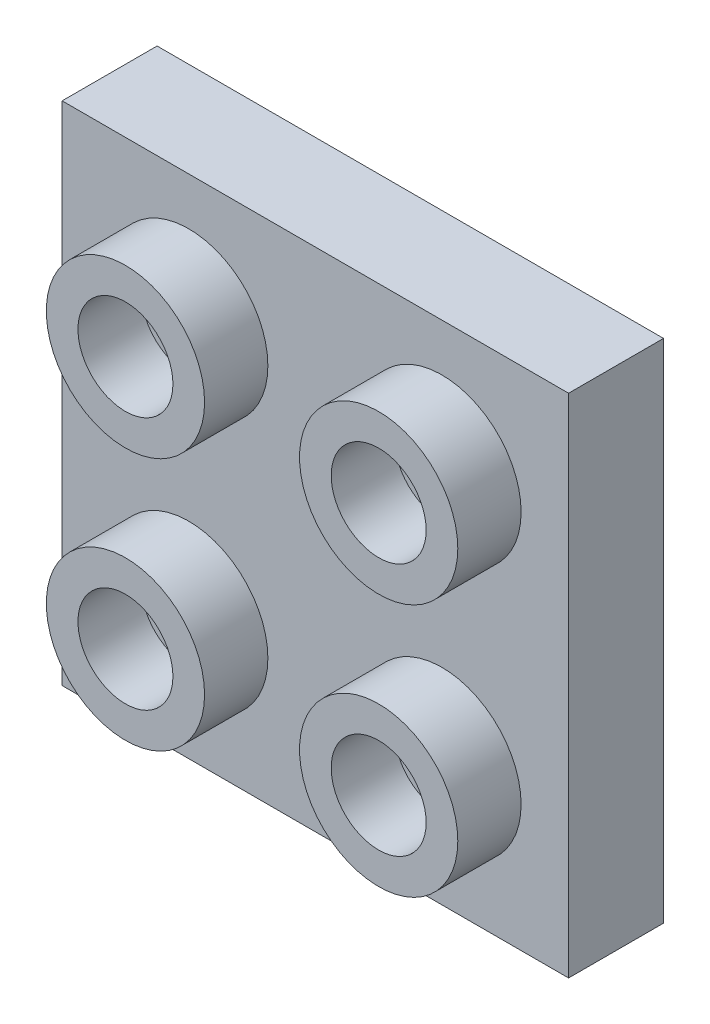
from build123d import *

# Parameters (mm, degrees)
SKETCH_1_W                  = 16
SKETCH_1_H                  = 16
EXTRUDE_340_DEPTH           = 3
SKETCH_2_R                  = 2.5
EXTRUDE_1_DEPTH             = 2
PATTERN_LINEAR_1_COUNT      = 2
PATTERN_LINEAR_1_PITCH      = 8
PATTERN_LINEAR_1_COUNT_DIR2 = 2
PATTERN_LINEAR_1_PITCH_DIR2 = 8
SKETCH_3_W                  = 13
SKETCH_3_H                  = 13
CUT_EXTRUDE_1_DEPTH         = 2
BOSS_EXTRUDE1_DEPTH         = 7
SKETCH_5_R                  = 2.45
CUT_EXTRUDE1_DEPTH          = 7
SKETCH_6_R                  = 3
CUT_EXTRUDE_3_DEPTH         = 0.8
SKETCH_9_R                  = 1.5
CUT_EXTRUDE_6_DEPTH         = 2
PATTERN_LINEAR_2_COUNT      = 2
PATTERN_LINEAR_2_PITCH      = 8
PATTERN_LINEAR_2_COUNT_DIR2 = 2
PATTERN_LINEAR_2_PITCH_DIR2 = 8


with BuildPart() as part:
    # Sketch 1 → Extrude 340 (new body)
    with BuildSketch(Plane(origin=(0.007312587, -0.1312965, 0), x_dir=(1, 0, 0), z_dir=(0, 0, 1))):
        with Locations((-0.584916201, -0.000418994)):
            Rectangle(SKETCH_1_W, SKETCH_1_H)
    extrude(amount=-EXTRUDE_340_DEPTH)

    # Sketch 2 → Extrude 1 (add)
    with BuildSketch(Plane.XY):
        with Locations((-4.577603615, -4.131715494)):
            Circle(SKETCH_2_R)
    extrude_1 = extrude(amount=EXTRUDE_1_DEPTH)

    # Pattern Linear 1: Extrude 1 2 × 2
    with Locations(*[(i * PATTERN_LINEAR_1_PITCH, j * PATTERN_LINEAR_1_PITCH_DIR2, 0) for i in range(PATTERN_LINEAR_1_COUNT) for j in range(PATTERN_LINEAR_1_COUNT_DIR2) if (i, j) != (0, 0)]):
        add(extrude_1)

    # Sketch 3 → Cut-Extrude 1 (cut)
    with BuildSketch(Plane(origin=(0, 0, -3), x_dir=(-1, 0, 0), z_dir=(0, 0, -1))):
        with Locations((0.577603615, -0.131715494)):
            Rectangle(SKETCH_3_W, SKETCH_3_H)
    extrude(amount=-CUT_EXTRUDE_1_DEPTH, mode=Mode.SUBTRACT)

    # Sketch 4 → Boss-Extrude1 (add)
    with BuildSketch(Plane.XZ.offset(8.131715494)):
        with BuildLine():
            Line((3.422396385, -3.5), (3.422396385, 0))
            Line((3.422396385, 0), (-4.577603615, 0))
            Line((-4.577603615, 0), (-4.577603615, -3.5))
            ThreePointArc((-4.577603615, -3.5), (-0.577603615, -7.5), (3.422396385, -3.5))
        make_face()
    extrude(amount=-BOSS_EXTRUDE1_DEPTH)

    # Sketch 5 → Cut-Extrude1 (cut)
    with BuildSketch(Plane.XZ.offset(8.131715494)):
        with Locations(Location((-0.577603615, -3.5, 0), (0, 0, 270))):
            Circle(SKETCH_5_R)
    extrude(amount=-CUT_EXTRUDE1_DEPTH, mode=Mode.SUBTRACT)

    # Sketch 6 → Cut-Extrude 3 (cut)
    with BuildSketch(Plane.XZ.offset(8.131715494)):
        with Locations(Location((-0.577603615, -3.5, 0), (0, 0, 270))):
            Circle(SKETCH_6_R)
    extrude(amount=-CUT_EXTRUDE_3_DEPTH, mode=Mode.SUBTRACT)

    # Sketch 9 → Cut-Extrude 6 (cut)
    with BuildSketch(Plane.XY.offset(2)):
        with Locations((-4.577603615, -4.131715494)):
            Circle(SKETCH_9_R)
    cut_extrude_6 = extrude(amount=-CUT_EXTRUDE_6_DEPTH, mode=Mode.SUBTRACT)

    # Pattern Linear 2: Cut-Extrude 6 2 × 2
    with Locations(*[(j * PATTERN_LINEAR_2_PITCH_DIR2, i * PATTERN_LINEAR_2_PITCH, 0) for i in range(PATTERN_LINEAR_2_COUNT) for j in range(PATTERN_LINEAR_2_COUNT_DIR2) if (i, j) != (0, 0)]):
        add(cut_extrude_6, mode=Mode.SUBTRACT)


solid = part.part
